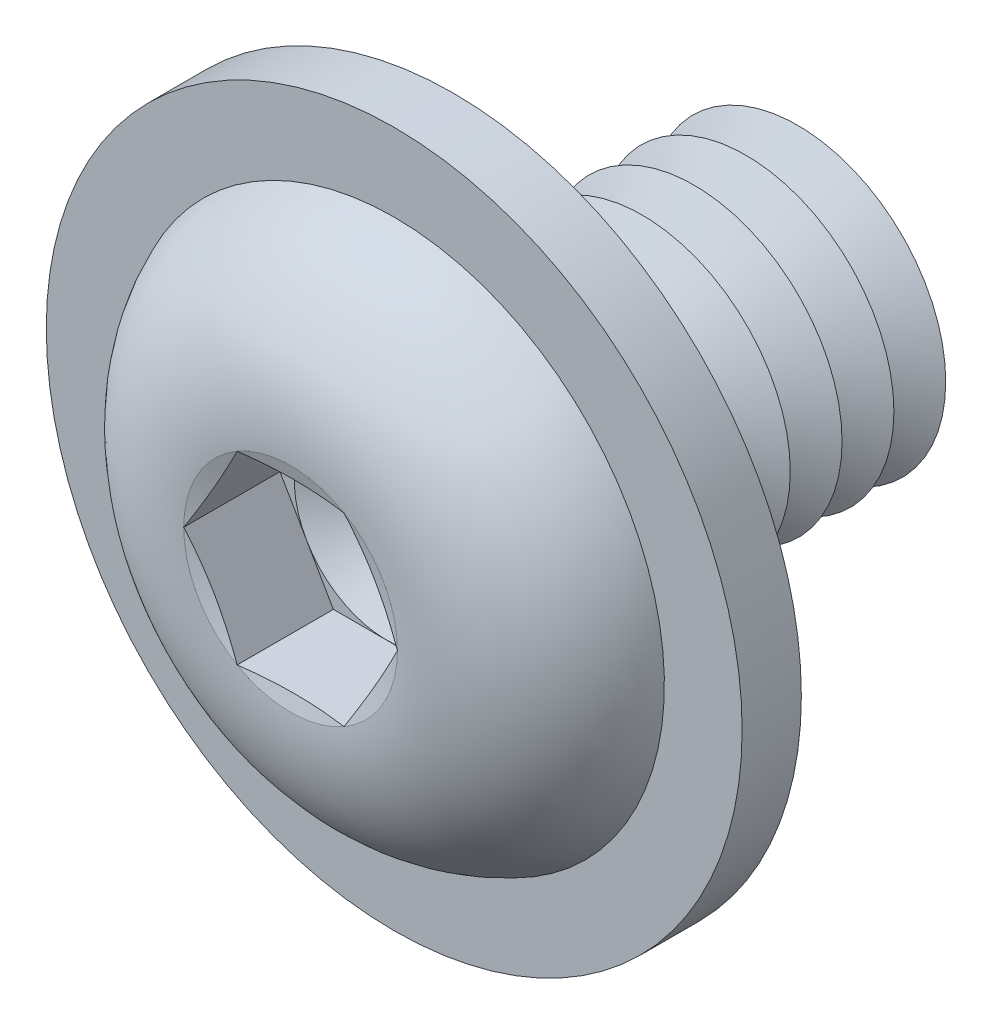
ISO-10303-21;
HEADER;
FILE_DESCRIPTION(('STEP AP214'),'2;1');
FILE_NAME('part.step','',(''),(''),'','','');
FILE_SCHEMA(('AUTOMOTIVE_DESIGN { 1 0 10303 214 1 1 1 1 }'));
ENDSEC;
DATA;
#1=APPLICATION_CONTEXT('core data for automotive mechanical design processes');
#2=APPLICATION_PROTOCOL_DEFINITION('international standard','automotive_design',2000,#1);
#3=PRODUCT_CONTEXT('',#1,'mechanical');
#4=PRODUCT('Part','Part','',(#3));
#5=PRODUCT_RELATED_PRODUCT_CATEGORY('part','',(#4));
#6=PRODUCT_DEFINITION_FORMATION('','',#4);
#7=PRODUCT_DEFINITION_CONTEXT('part definition',#1,'design');
#8=PRODUCT_DEFINITION('design','',#6,#7);
#9=PRODUCT_DEFINITION_SHAPE('','',#8);
#10=(LENGTH_UNIT() NAMED_UNIT(*) SI_UNIT(.MILLI.,.METRE.));
#11=(NAMED_UNIT(*) PLANE_ANGLE_UNIT() SI_UNIT($,.RADIAN.));
#12=(NAMED_UNIT(*) SI_UNIT($,.STERADIAN.) SOLID_ANGLE_UNIT());
#13=UNCERTAINTY_MEASURE_WITH_UNIT(LENGTH_MEASURE(1.E-05),#10,'distance_accuracy_value','');
#14=(GEOMETRIC_REPRESENTATION_CONTEXT(3) GLOBAL_UNCERTAINTY_ASSIGNED_CONTEXT((#13)) GLOBAL_UNIT_ASSIGNED_CONTEXT((#10,
#11,#12)) REPRESENTATION_CONTEXT('',''));
#15=CARTESIAN_POINT('',(0.,0.,0.));
#16=DIRECTION('',(0.,0.,1.));
#17=DIRECTION('',(1.,0.,0.));
#18=AXIS2_PLACEMENT_3D('',#15,#16,#17);
#19=CARTESIAN_POINT('',(0.,0.,-2.55));
#20=DIRECTION('',(0.,0.,1.));
#21=DIRECTION('',(1.,0.,0.));
#22=AXIS2_PLACEMENT_3D('',#19,#20,#21);
#23=CONICAL_SURFACE('',#22,2.,1.0471975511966);
#24=CARTESIAN_POINT('',(0.,0.,-2.9));
#25=DIRECTION('',(0.,0.,1.));
#26=DIRECTION('',(1.,0.,0.));
#27=AXIS2_PLACEMENT_3D('',#24,#25,#26);
#28=CIRCLE('',#27,1.39378221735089);
#29=CARTESIAN_POINT('',(1.39378221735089,0.,-2.9));
#30=VERTEX_POINT('',#29);
#31=EDGE_CURVE('E267',#30,#30,#28,.T.);
#32=ORIENTED_EDGE('',*,*,#31,.T.);
#33=EDGE_LOOP('',(#32));
#34=FACE_BOUND('',#33,.T.);
#35=CARTESIAN_POINT('',(0.,0.,-2.55));
#36=DIRECTION('',(0.,0.,1.));
#37=DIRECTION('',(1.,0.,0.));
#38=AXIS2_PLACEMENT_3D('',#35,#36,#37);
#39=CIRCLE('',#38,2.);
#40=CARTESIAN_POINT('',(2.,0.,-2.55));
#41=VERTEX_POINT('',#40);
#42=EDGE_CURVE('E263',#41,#41,#39,.T.);
#43=ORIENTED_EDGE('',*,*,#42,.F.);
#44=EDGE_LOOP('',(#43));
#45=FACE_BOUND('',#44,.T.);
#46=ADVANCED_FACE('F39',(#34,#45),#23,.T.);
#47=CARTESIAN_POINT('',(0.,0.,-2.9));
#48=DIRECTION('',(0.,0.,-1.));
#49=DIRECTION('',(-1.,0.,0.));
#50=AXIS2_PLACEMENT_3D('',#47,#48,#49);
#51=CONICAL_SURFACE('',#50,1.39378221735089,1.0471975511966);
#52=CARTESIAN_POINT('',(0.,0.,-3.25));
#53=DIRECTION('',(0.,0.,1.));
#54=DIRECTION('',(1.,0.,0.));
#55=AXIS2_PLACEMENT_3D('',#52,#53,#54);
#56=CIRCLE('',#55,2.);
#57=CARTESIAN_POINT('',(2.,0.,-3.25));
#58=VERTEX_POINT('',#57);
#59=EDGE_CURVE('E271',#58,#58,#56,.T.);
#60=ORIENTED_EDGE('',*,*,#59,.T.);
#61=EDGE_LOOP('',(#60));
#62=FACE_BOUND('',#61,.T.);
#63=ORIENTED_EDGE('',*,*,#31,.F.);
#64=EDGE_LOOP('',(#63));
#65=FACE_BOUND('',#64,.T.);
#66=ADVANCED_FACE('F388',(#62,#65),#51,.T.);
#67=CARTESIAN_POINT('',(0.,2.,-5.));
#68=DIRECTION('',(0.,0.,-1.));
#69=DIRECTION('',(-1.,0.,0.));
#70=AXIS2_PLACEMENT_3D('',#67,#68,#69);
#71=PLANE('',#70);
#72=CARTESIAN_POINT('',(0.,0.,-5.));
#73=DIRECTION('',(0.,0.,1.));
#74=DIRECTION('',(1.,0.,0.));
#75=AXIS2_PLACEMENT_3D('',#72,#73,#74);
#76=CIRCLE('',#75,1.39378221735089);
#77=CARTESIAN_POINT('',(1.39378221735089,0.,-5.));
#78=VERTEX_POINT('',#77);
#79=EDGE_CURVE('E291',#78,#78,#76,.T.);
#80=ORIENTED_EDGE('',*,*,#79,.F.);
#81=EDGE_LOOP('',(#80));
#82=FACE_BOUND('',#81,.T.);
#83=ADVANCED_FACE('F394',(#82),#71,.T.);
#84=CARTESIAN_POINT('',(0.,0.,-4.65));
#85=DIRECTION('',(0.,0.,1.));
#86=DIRECTION('',(1.,0.,0.));
#87=AXIS2_PLACEMENT_3D('',#84,#85,#86);
#88=CONICAL_SURFACE('',#87,2.,1.0471975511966);
#89=ORIENTED_EDGE('',*,*,#79,.T.);
#90=EDGE_LOOP('',(#89));
#91=FACE_BOUND('',#90,.T.);
#92=CARTESIAN_POINT('',(0.,0.,-4.65));
#93=DIRECTION('',(0.,0.,1.));
#94=DIRECTION('',(1.,0.,0.));
#95=AXIS2_PLACEMENT_3D('',#92,#93,#94);
#96=CIRCLE('',#95,2.);
#97=CARTESIAN_POINT('',(2.,0.,-4.65));
#98=VERTEX_POINT('',#97);
#99=EDGE_CURVE('E287',#98,#98,#96,.T.);
#100=ORIENTED_EDGE('',*,*,#99,.F.);
#101=EDGE_LOOP('',(#100));
#102=FACE_BOUND('',#101,.T.);
#103=ADVANCED_FACE('F413',(#91,#102),#88,.T.);
#104=CARTESIAN_POINT('',(0.,0.,-4.3));
#105=DIRECTION('',(0.,0.,-1.));
#106=DIRECTION('',(-1.,0.,0.));
#107=AXIS2_PLACEMENT_3D('',#104,#105,#106);
#108=CONICAL_SURFACE('',#107,1.39378221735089,1.0471975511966);
#109=ORIENTED_EDGE('',*,*,#99,.T.);
#110=EDGE_LOOP('',(#109));
#111=FACE_BOUND('',#110,.T.);
#112=CARTESIAN_POINT('',(0.,0.,-4.3));
#113=DIRECTION('',(0.,0.,1.));
#114=DIRECTION('',(1.,0.,0.));
#115=AXIS2_PLACEMENT_3D('',#112,#113,#114);
#116=CIRCLE('',#115,1.39378221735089);
#117=CARTESIAN_POINT('',(1.39378221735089,0.,-4.3));
#118=VERTEX_POINT('',#117);
#119=EDGE_CURVE('E283',#118,#118,#116,.T.);
#120=ORIENTED_EDGE('',*,*,#119,.F.);
#121=EDGE_LOOP('',(#120));
#122=FACE_BOUND('',#121,.T.);
#123=ADVANCED_FACE('F410',(#111,#122),#108,.T.);
#124=CARTESIAN_POINT('',(0.,0.,-3.95));
#125=DIRECTION('',(0.,0.,1.));
#126=DIRECTION('',(1.,0.,0.));
#127=AXIS2_PLACEMENT_3D('',#124,#125,#126);
#128=CONICAL_SURFACE('',#127,2.,1.0471975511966);
#129=ORIENTED_EDGE('',*,*,#119,.T.);
#130=EDGE_LOOP('',(#129));
#131=FACE_BOUND('',#130,.T.);
#132=CARTESIAN_POINT('',(0.,0.,-3.95));
#133=DIRECTION('',(0.,0.,1.));
#134=DIRECTION('',(1.,0.,0.));
#135=AXIS2_PLACEMENT_3D('',#132,#133,#134);
#136=CIRCLE('',#135,2.);
#137=CARTESIAN_POINT('',(2.,0.,-3.95));
#138=VERTEX_POINT('',#137);
#139=EDGE_CURVE('E279',#138,#138,#136,.T.);
#140=ORIENTED_EDGE('',*,*,#139,.F.);
#141=EDGE_LOOP('',(#140));
#142=FACE_BOUND('',#141,.T.);
#143=ADVANCED_FACE('F404',(#131,#142),#128,.T.);
#144=CARTESIAN_POINT('',(0.,0.,-3.6));
#145=DIRECTION('',(0.,0.,-1.));
#146=DIRECTION('',(-1.,0.,0.));
#147=AXIS2_PLACEMENT_3D('',#144,#145,#146);
#148=CONICAL_SURFACE('',#147,1.39378221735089,1.0471975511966);
#149=ORIENTED_EDGE('',*,*,#139,.T.);
#150=EDGE_LOOP('',(#149));
#151=FACE_BOUND('',#150,.T.);
#152=CARTESIAN_POINT('',(0.,0.,-3.6));
#153=DIRECTION('',(0.,0.,1.));
#154=DIRECTION('',(1.,0.,0.));
#155=AXIS2_PLACEMENT_3D('',#152,#153,#154);
#156=CIRCLE('',#155,1.39378221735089);
#157=CARTESIAN_POINT('',(1.39378221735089,0.,-3.6));
#158=VERTEX_POINT('',#157);
#159=EDGE_CURVE('E275',#158,#158,#156,.T.);
#160=ORIENTED_EDGE('',*,*,#159,.F.);
#161=EDGE_LOOP('',(#160));
#162=FACE_BOUND('',#161,.T.);
#163=ADVANCED_FACE('F400',(#151,#162),#148,.T.);
#164=CARTESIAN_POINT('',(0.,0.,-3.25));
#165=DIRECTION('',(0.,0.,1.));
#166=DIRECTION('',(1.,0.,0.));
#167=AXIS2_PLACEMENT_3D('',#164,#165,#166);
#168=CONICAL_SURFACE('',#167,2.,1.0471975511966);
#169=ORIENTED_EDGE('',*,*,#159,.T.);
#170=EDGE_LOOP('',(#169));
#171=FACE_BOUND('',#170,.T.);
#172=ORIENTED_EDGE('',*,*,#59,.F.);
#173=EDGE_LOOP('',(#172));
#174=FACE_BOUND('',#173,.T.);
#175=ADVANCED_FACE('F403',(#171,#174),#168,.T.);
#176=CARTESIAN_POINT('',(0.,0.,-1.85));
#177=DIRECTION('',(0.,0.,1.));
#178=DIRECTION('',(1.,0.,0.));
#179=AXIS2_PLACEMENT_3D('',#176,#177,#178);
#180=CONICAL_SURFACE('',#179,2.,1.0471975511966);
#181=CARTESIAN_POINT('',(0.,0.,-2.2));
#182=DIRECTION('',(0.,0.,1.));
#183=DIRECTION('',(1.,0.,0.));
#184=AXIS2_PLACEMENT_3D('',#181,#182,#183);
#185=CIRCLE('',#184,1.39378221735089);
#186=CARTESIAN_POINT('',(1.39378221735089,0.,-2.2));
#187=VERTEX_POINT('',#186);
#188=EDGE_CURVE('E259',#187,#187,#185,.T.);
#189=ORIENTED_EDGE('',*,*,#188,.T.);
#190=EDGE_LOOP('',(#189));
#191=FACE_BOUND('',#190,.T.);
#192=CARTESIAN_POINT('',(0.,0.,-1.85));
#193=DIRECTION('',(0.,0.,1.));
#194=DIRECTION('',(1.,0.,0.));
#195=AXIS2_PLACEMENT_3D('',#192,#193,#194);
#196=CIRCLE('',#195,2.);
#197=CARTESIAN_POINT('',(2.,0.,-1.85));
#198=VERTEX_POINT('',#197);
#199=EDGE_CURVE('E255',#198,#198,#196,.T.);
#200=ORIENTED_EDGE('',*,*,#199,.F.);
#201=EDGE_LOOP('',(#200));
#202=FACE_BOUND('',#201,.T.);
#203=ADVANCED_FACE('F408',(#191,#202),#180,.T.);
#204=CARTESIAN_POINT('',(0.,0.,-2.2));
#205=DIRECTION('',(0.,0.,-1.));
#206=DIRECTION('',(-1.,0.,0.));
#207=AXIS2_PLACEMENT_3D('',#204,#205,#206);
#208=CONICAL_SURFACE('',#207,1.39378221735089,1.0471975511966);
#209=ORIENTED_EDGE('',*,*,#42,.T.);
#210=EDGE_LOOP('',(#209));
#211=FACE_BOUND('',#210,.T.);
#212=ORIENTED_EDGE('',*,*,#188,.F.);
#213=EDGE_LOOP('',(#212));
#214=FACE_BOUND('',#213,.T.);
#215=ADVANCED_FACE('F459',(#211,#214),#208,.T.);
#216=CARTESIAN_POINT('',(0.,0.,-1.15));
#217=DIRECTION('',(0.,0.,1.));
#218=DIRECTION('',(1.,0.,0.));
#219=AXIS2_PLACEMENT_3D('',#216,#217,#218);
#220=CONICAL_SURFACE('',#219,2.,1.0471975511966);
#221=CARTESIAN_POINT('',(0.,0.,-1.5));
#222=DIRECTION('',(0.,0.,1.));
#223=DIRECTION('',(1.,0.,0.));
#224=AXIS2_PLACEMENT_3D('',#221,#222,#223);
#225=CIRCLE('',#224,1.39378221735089);
#226=CARTESIAN_POINT('',(1.39378221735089,0.,-1.5));
#227=VERTEX_POINT('',#226);
#228=EDGE_CURVE('E251',#227,#227,#225,.T.);
#229=ORIENTED_EDGE('',*,*,#228,.T.);
#230=EDGE_LOOP('',(#229));
#231=FACE_BOUND('',#230,.T.);
#232=CARTESIAN_POINT('',(0.,0.,-1.15));
#233=DIRECTION('',(0.,0.,1.));
#234=DIRECTION('',(1.,0.,0.));
#235=AXIS2_PLACEMENT_3D('',#232,#233,#234);
#236=CIRCLE('',#235,2.);
#237=CARTESIAN_POINT('',(2.,0.,-1.15));
#238=VERTEX_POINT('',#237);
#239=EDGE_CURVE('E243',#238,#238,#236,.T.);
#240=ORIENTED_EDGE('',*,*,#239,.F.);
#241=EDGE_LOOP('',(#240));
#242=FACE_BOUND('',#241,.T.);
#243=ADVANCED_FACE('F465',(#231,#242),#220,.T.);
#244=CARTESIAN_POINT('',(0.,0.,-1.5));
#245=DIRECTION('',(0.,0.,-1.));
#246=DIRECTION('',(-1.,0.,0.));
#247=AXIS2_PLACEMENT_3D('',#244,#245,#246);
#248=CONICAL_SURFACE('',#247,1.39378221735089,1.0471975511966);
#249=ORIENTED_EDGE('',*,*,#199,.T.);
#250=EDGE_LOOP('',(#249));
#251=FACE_BOUND('',#250,.T.);
#252=ORIENTED_EDGE('',*,*,#228,.F.);
#253=EDGE_LOOP('',(#252));
#254=FACE_BOUND('',#253,.T.);
#255=ADVANCED_FACE('F472',(#251,#254),#248,.T.);
#256=CARTESIAN_POINT('',(0.,0.,-0.45));
#257=DIRECTION('',(0.,0.,1.));
#258=DIRECTION('',(1.,0.,0.));
#259=AXIS2_PLACEMENT_3D('',#256,#257,#258);
#260=CONICAL_SURFACE('',#259,2.,1.0471975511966);
#261=CARTESIAN_POINT('',(0.,0.,-0.799999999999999));
#262=DIRECTION('',(0.,0.,1.));
#263=DIRECTION('',(1.,0.,0.));
#264=AXIS2_PLACEMENT_3D('',#261,#262,#263);
#265=CIRCLE('',#264,1.39378221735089);
#266=CARTESIAN_POINT('',(1.39378221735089,0.,-0.799999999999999));
#267=VERTEX_POINT('',#266);
#268=EDGE_CURVE('E232',#267,#267,#265,.T.);
#269=ORIENTED_EDGE('',*,*,#268,.T.);
#270=EDGE_LOOP('',(#269));
#271=FACE_BOUND('',#270,.T.);
#272=CARTESIAN_POINT('',(0.,0.,-0.45));
#273=DIRECTION('',(0.,0.,1.));
#274=DIRECTION('',(1.,0.,0.));
#275=AXIS2_PLACEMENT_3D('',#272,#273,#274);
#276=CIRCLE('',#275,2.);
#277=CARTESIAN_POINT('',(2.,0.,-0.45));
#278=VERTEX_POINT('',#277);
#279=EDGE_CURVE('E247',#278,#278,#276,.T.);
#280=ORIENTED_EDGE('',*,*,#279,.F.);
#281=EDGE_LOOP('',(#280));
#282=FACE_BOUND('',#281,.T.);
#283=ADVANCED_FACE('F479',(#271,#282),#260,.T.);
#284=CARTESIAN_POINT('',(0.,0.,-0.799999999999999));
#285=DIRECTION('',(0.,0.,-1.));
#286=DIRECTION('',(-1.,0.,0.));
#287=AXIS2_PLACEMENT_3D('',#284,#285,#286);
#288=CONICAL_SURFACE('',#287,1.39378221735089,1.0471975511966);
#289=ORIENTED_EDGE('',*,*,#239,.T.);
#290=EDGE_LOOP('',(#289));
#291=FACE_BOUND('',#290,.T.);
#292=ORIENTED_EDGE('',*,*,#268,.F.);
#293=EDGE_LOOP('',(#292));
#294=FACE_BOUND('',#293,.T.);
#295=ADVANCED_FACE('F221',(#291,#294),#288,.T.);
#296=CARTESIAN_POINT('',(0.,2.,0.));
#297=DIRECTION('',(0.,0.,-1.));
#298=DIRECTION('',(-1.,0.,0.));
#299=AXIS2_PLACEMENT_3D('',#296,#297,#298);
#300=PLANE('',#299);
#301=CARTESIAN_POINT('',(0.,0.,0.));
#302=DIRECTION('',(0.,0.,-1.));
#303=DIRECTION('',(-1.,0.,0.));
#304=AXIS2_PLACEMENT_3D('',#301,#302,#303);
#305=CIRCLE('',#304,2.35);
#306=CARTESIAN_POINT('',(-2.35,0.,0.));
#307=VERTEX_POINT('',#306);
#308=EDGE_CURVE('E305',#307,#307,#305,.F.);
#309=ORIENTED_EDGE('',*,*,#308,.T.);
#310=EDGE_LOOP('',(#309));
#311=FACE_BOUND('',#310,.T.);
#312=CARTESIAN_POINT('',(0.,0.,0.));
#313=DIRECTION('',(0.,0.,-1.));
#314=DIRECTION('',(0.,1.,0.));
#315=AXIS2_PLACEMENT_3D('',#312,#313,#314);
#316=CIRCLE('',#315,4.7);
#317=CARTESIAN_POINT('',(0.,4.7,0.));
#318=VERTEX_POINT('',#317);
#319=EDGE_CURVE('E776',#318,#318,#316,.T.);
#320=ORIENTED_EDGE('',*,*,#319,.T.);
#321=EDGE_LOOP('',(#320));
#322=FACE_BOUND('',#321,.T.);
#323=ADVANCED_FACE('F491',(#311,#322),#300,.T.);
#324=CARTESIAN_POINT('',(0.,0.,-0.35));
#325=DIRECTION('',(0.,0.,-1.));
#326=DIRECTION('',(-1.,0.,0.));
#327=AXIS2_PLACEMENT_3D('',#324,#325,#326);
#328=TOROIDAL_SURFACE('',#327,2.35,0.35);
#329=ORIENTED_EDGE('',*,*,#308,.F.);
#330=EDGE_LOOP('',(#329));
#331=FACE_BOUND('',#330,.T.);
#332=CARTESIAN_POINT('',(0.,0.,-0.35));
#333=DIRECTION('',(0.,0.,-1.));
#334=DIRECTION('',(-1.,0.,0.));
#335=AXIS2_PLACEMENT_3D('',#332,#333,#334);
#336=CIRCLE('',#335,2.);
#337=CARTESIAN_POINT('',(-2.,0.,-0.35));
#338=VERTEX_POINT('',#337);
#339=EDGE_CURVE('E300',#338,#338,#336,.T.);
#340=ORIENTED_EDGE('',*,*,#339,.F.);
#341=EDGE_LOOP('',(#340));
#342=FACE_BOUND('',#341,.T.);
#343=ADVANCED_FACE('F41',(#331,#342),#328,.F.);
#344=CARTESIAN_POINT('',(0.,0.,-5.));
#345=DIRECTION('',(0.,0.,-1.));
#346=DIRECTION('',(-1.,0.,0.));
#347=AXIS2_PLACEMENT_3D('',#344,#345,#346);
#348=CYLINDRICAL_SURFACE('',#347,2.);
#349=ORIENTED_EDGE('',*,*,#339,.T.);
#350=EDGE_LOOP('',(#349));
#351=FACE_BOUND('',#350,.T.);
#352=ORIENTED_EDGE('',*,*,#279,.T.);
#353=EDGE_LOOP('',(#352));
#354=FACE_BOUND('',#353,.T.);
#355=ADVANCED_FACE('F503',(#351,#354),#348,.T.);
#356=CARTESIAN_POINT('',(0.,0.,0.8));
#357=DIRECTION('',(0.,0.,-1.));
#358=DIRECTION('',(0.,1.,0.));
#359=AXIS2_PLACEMENT_3D('',#356,#357,#358);
#360=CYLINDRICAL_SURFACE('',#359,4.7);
#361=CARTESIAN_POINT('',(0.,0.,0.8));
#362=DIRECTION('',(0.,0.,-1.));
#363=DIRECTION('',(0.,1.,0.));
#364=AXIS2_PLACEMENT_3D('',#361,#362,#363);
#365=CIRCLE('',#364,4.7);
#366=CARTESIAN_POINT('',(0.,4.7,0.8));
#367=VERTEX_POINT('',#366);
#368=EDGE_CURVE('E778',#367,#367,#365,.T.);
#369=ORIENTED_EDGE('',*,*,#368,.T.);
#370=EDGE_LOOP('',(#369));
#371=FACE_BOUND('',#370,.T.);
#372=ORIENTED_EDGE('',*,*,#319,.F.);
#373=EDGE_LOOP('',(#372));
#374=FACE_BOUND('',#373,.T.);
#375=ADVANCED_FACE('F509',(#371,#374),#360,.T.);
#376=CARTESIAN_POINT('',(0.,0.,0.8));
#377=DIRECTION('',(0.,0.,-1.));
#378=DIRECTION('',(0.,1.,0.));
#379=AXIS2_PLACEMENT_3D('',#376,#377,#378);
#380=PLANE('',#379);
#381=CARTESIAN_POINT('',(0.,0.,0.8));
#382=DIRECTION('',(0.,0.,-1.));
#383=DIRECTION('',(0.,1.,0.));
#384=AXIS2_PLACEMENT_3D('',#381,#382,#383);
#385=CIRCLE('',#384,3.64977164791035);
#386=CARTESIAN_POINT('',(0.,3.64977164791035,0.8));
#387=VERTEX_POINT('',#386);
#388=EDGE_CURVE('E43',#387,#387,#385,.F.);
#389=ORIENTED_EDGE('',*,*,#388,.F.);
#390=EDGE_LOOP('',(#389));
#391=FACE_BOUND('',#390,.T.);
#392=ORIENTED_EDGE('',*,*,#368,.F.);
#393=EDGE_LOOP('',(#392));
#394=FACE_BOUND('',#393,.T.);
#395=ADVANCED_FACE('F117',(#391,#394),#380,.F.);
#396=CARTESIAN_POINT('',(0.,0.,0.9));
#397=DIRECTION('',(0.,0.,1.));
#398=DIRECTION('',(1.,0.,0.));
#399=AXIS2_PLACEMENT_3D('',#396,#397,#398);
#400=CONICAL_SURFACE('',#399,1.24999941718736,1.0471975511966);
#401=CARTESIAN_POINT('',(0.,0.,0.178312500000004));
#402=VERTEX_POINT('',#401);
#403=VERTEX_LOOP('',#402);
#404=FACE_BOUND('',#403,.T.);
#405=CARTESIAN_POINT('',(0.,0.,0.9));
#406=DIRECTION('',(0.,0.,1.));
#407=DIRECTION('',(1.,0.,0.));
#408=AXIS2_PLACEMENT_3D('',#405,#406,#407);
#409=CIRCLE('',#408,1.24999941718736);
#410=CARTESIAN_POINT('',(1.08253125,0.624999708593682,0.9));
#411=VERTEX_POINT('',#410);
#412=CARTESIAN_POINT('',(0.,1.24999941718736,0.9));
#413=VERTEX_POINT('',#412);
#414=EDGE_CURVE('E120',#411,#413,#409,.T.);
#415=ORIENTED_EDGE('',*,*,#414,.T.);
#416=CARTESIAN_POINT('',(0.,0.,0.9));
#417=DIRECTION('',(0.,0.,1.));
#418=DIRECTION('',(1.,0.,0.));
#419=AXIS2_PLACEMENT_3D('',#416,#417,#418);
#420=CIRCLE('',#419,1.24999941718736);
#421=CARTESIAN_POINT('',(-1.08253125,0.624999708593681,0.9));
#422=VERTEX_POINT('',#421);
#423=EDGE_CURVE('E11',#413,#422,#420,.T.);
#424=ORIENTED_EDGE('',*,*,#423,.T.);
#425=CARTESIAN_POINT('',(-1.08253125,-0.624999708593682,0.9));
#426=VERTEX_POINT('',#425);
#427=EDGE_CURVE('E49',#422,#426,#420,.T.);
#428=ORIENTED_EDGE('',*,*,#427,.T.);
#429=CARTESIAN_POINT('',(0.,-1.24999941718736,0.9));
#430=VERTEX_POINT('',#429);
#431=EDGE_CURVE('E312',#426,#430,#420,.T.);
#432=ORIENTED_EDGE('',*,*,#431,.T.);
#433=CARTESIAN_POINT('',(1.08253125,-0.624999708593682,0.9));
#434=VERTEX_POINT('',#433);
#435=EDGE_CURVE('E57',#430,#434,#420,.T.);
#436=ORIENTED_EDGE('',*,*,#435,.T.);
#437=EDGE_CURVE('E50',#434,#411,#420,.T.);
#438=ORIENTED_EDGE('',*,*,#437,.T.);
#439=EDGE_LOOP('',(#415,#424,#428,#432,#436,#438));
#440=FACE_BOUND('',#439,.T.);
#441=ADVANCED_FACE('F114',(#404,#440),#400,.F.);
#442=CARTESIAN_POINT('',(0.,0.,0.9));
#443=DIRECTION('',(0.,0.,1.));
#444=DIRECTION('',(1.,0.,0.));
#445=AXIS2_PLACEMENT_3D('',#442,#443,#444);
#446=PLANE('',#445);
#447=ORIENTED_EDGE('',*,*,#431,.F.);
#448=DIRECTION('',(0.5,-0.866025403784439,0.));
#449=VECTOR('',#448,1.);
#450=CARTESIAN_POINT('',(-1.443375,0.,0.9));
#451=LINE('',#450,#449);
#452=CARTESIAN_POINT('',(-0.7216875,-1.24999941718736,0.9));
#453=VERTEX_POINT('',#452);
#454=EDGE_CURVE('E154',#426,#453,#451,.T.);
#455=ORIENTED_EDGE('',*,*,#454,.T.);
#456=DIRECTION('',(1.,0.,0.));
#457=VECTOR('',#456,1.);
#458=CARTESIAN_POINT('',(-0.7216875,-1.24999941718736,0.9));
#459=LINE('',#458,#457);
#460=EDGE_CURVE('E160',#453,#430,#459,.T.);
#461=ORIENTED_EDGE('',*,*,#460,.T.);
#462=EDGE_LOOP('',(#447,#455,#461));
#463=FACE_BOUND('',#462,.T.);
#464=ADVANCED_FACE('F116',(#463),#446,.T.);
#465=ORIENTED_EDGE('',*,*,#435,.F.);
#466=CARTESIAN_POINT('',(0.721687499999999,-1.24999941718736,0.9));
#467=VERTEX_POINT('',#466);
#468=EDGE_CURVE('E159',#430,#467,#459,.T.);
#469=ORIENTED_EDGE('',*,*,#468,.T.);
#470=DIRECTION('',(0.5,0.866025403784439,0.));
#471=VECTOR('',#470,1.);
#472=CARTESIAN_POINT('',(0.721687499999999,-1.24999941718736,0.9));
#473=LINE('',#472,#471);
#474=EDGE_CURVE('E165',#467,#434,#473,.T.);
#475=ORIENTED_EDGE('',*,*,#474,.T.);
#476=EDGE_LOOP('',(#465,#469,#475));
#477=FACE_BOUND('',#476,.T.);
#478=ADVANCED_FACE('F530',(#477),#446,.T.);
#479=ORIENTED_EDGE('',*,*,#437,.F.);
#480=CARTESIAN_POINT('',(1.443375,0.,0.9));
#481=VERTEX_POINT('',#480);
#482=EDGE_CURVE('E164',#434,#481,#473,.T.);
#483=ORIENTED_EDGE('',*,*,#482,.T.);
#484=DIRECTION('',(-0.5,0.866025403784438,0.));
#485=VECTOR('',#484,1.);
#486=CARTESIAN_POINT('',(1.443375,0.,0.9));
#487=LINE('',#486,#485);
#488=EDGE_CURVE('E142',#481,#411,#487,.T.);
#489=ORIENTED_EDGE('',*,*,#488,.T.);
#490=EDGE_LOOP('',(#479,#483,#489));
#491=FACE_BOUND('',#490,.T.);
#492=ADVANCED_FACE('F535',(#491),#446,.T.);
#493=ORIENTED_EDGE('',*,*,#414,.F.);
#494=CARTESIAN_POINT('',(0.7216875,1.24999941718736,0.9));
#495=VERTEX_POINT('',#494);
#496=EDGE_CURVE('E127',#411,#495,#487,.T.);
#497=ORIENTED_EDGE('',*,*,#496,.T.);
#498=DIRECTION('',(-1.,0.,0.));
#499=VECTOR('',#498,1.);
#500=CARTESIAN_POINT('',(0.7216875,1.24999941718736,0.9));
#501=LINE('',#500,#499);
#502=EDGE_CURVE('E138',#495,#413,#501,.T.);
#503=ORIENTED_EDGE('',*,*,#502,.T.);
#504=EDGE_LOOP('',(#493,#497,#503));
#505=FACE_BOUND('',#504,.T.);
#506=ADVANCED_FACE('F144',(#505),#446,.T.);
#507=ORIENTED_EDGE('',*,*,#423,.F.);
#508=CARTESIAN_POINT('',(-0.721687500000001,1.24999941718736,0.9));
#509=VERTEX_POINT('',#508);
#510=EDGE_CURVE('E133',#413,#509,#501,.T.);
#511=ORIENTED_EDGE('',*,*,#510,.T.);
#512=DIRECTION('',(-0.5,-0.866025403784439,0.));
#513=VECTOR('',#512,1.);
#514=CARTESIAN_POINT('',(-0.721687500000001,1.24999941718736,0.9));
#515=LINE('',#514,#513);
#516=EDGE_CURVE('E136',#509,#422,#515,.T.);
#517=ORIENTED_EDGE('',*,*,#516,.T.);
#518=EDGE_LOOP('',(#507,#511,#517));
#519=FACE_BOUND('',#518,.T.);
#520=ADVANCED_FACE('F132',(#519),#446,.T.);
#521=ORIENTED_EDGE('',*,*,#427,.F.);
#522=CARTESIAN_POINT('',(-1.443375,0.,0.9));
#523=VERTEX_POINT('',#522);
#524=EDGE_CURVE('E146',#422,#523,#515,.T.);
#525=ORIENTED_EDGE('',*,*,#524,.T.);
#526=EDGE_CURVE('E155',#523,#426,#451,.T.);
#527=ORIENTED_EDGE('',*,*,#526,.T.);
#528=EDGE_LOOP('',(#521,#525,#527));
#529=FACE_BOUND('',#528,.T.);
#530=ADVANCED_FACE('F327',(#529),#446,.T.);
#531=CARTESIAN_POINT('',(-1.443375,0.,0.9));
#532=DIRECTION('',(-0.866025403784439,-0.5,0.));
#533=DIRECTION('',(0.5,-0.866025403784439,0.));
#534=AXIS2_PLACEMENT_3D('',#531,#532,#533);
#535=PLANE('',#534);
#536=CARTESIAN_POINT('',(-1.44349047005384,0.000200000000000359,2.20003094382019));
#537=CARTESIAN_POINT('',(-1.41351104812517,-0.0517258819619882,2.19199301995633));
#538=CARTESIAN_POINT('',(-1.38347725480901,-0.10374593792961,2.18469579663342));
#539=CARTESIAN_POINT('',(-1.32330355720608,-0.20796983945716,2.17187512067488));
#540=CARTESIAN_POINT('',(-1.29316361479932,-0.260173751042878,2.16635238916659));
#541=CARTESIAN_POINT('',(-1.23296043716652,-0.364448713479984,2.15740323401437));
#542=CARTESIAN_POINT('',(-1.20289760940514,-0.416519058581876,2.15396613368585));
#543=CARTESIAN_POINT('',(-1.14273359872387,-0.520726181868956,2.14935732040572));
#544=CARTESIAN_POINT('',(-1.11263242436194,-0.572862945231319,2.14818516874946));
#545=CARTESIAN_POINT('',(-1.05243007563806,-0.677136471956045,2.14818516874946));
#546=CARTESIAN_POINT('',(-1.02232890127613,-0.729273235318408,2.14935732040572));
#547=CARTESIAN_POINT('',(-0.962164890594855,-0.833480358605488,2.15396613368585));
#548=CARTESIAN_POINT('',(-0.932102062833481,-0.88555070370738,2.15740323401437));
#549=CARTESIAN_POINT('',(-0.87189888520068,-0.989825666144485,2.16635238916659));
#550=CARTESIAN_POINT('',(-0.841758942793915,-1.0420295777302,2.17187512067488));
#551=CARTESIAN_POINT('',(-0.78158524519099,-1.14625347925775,2.18469579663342));
#552=CARTESIAN_POINT('',(-0.751551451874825,-1.19827353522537,2.19199301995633));
#553=CARTESIAN_POINT('',(-0.721572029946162,-1.25019941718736,2.20003094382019));
#554=B_SPLINE_CURVE_WITH_KNOTS('',3,(#536,#537,#538,#539,#540,#541,#542,#543,#544,#545,#546,
#547,#548,#549,#550,#551,#552,#553),.UNSPECIFIED.,.F.,.F.,(4,2,2,2,2,2,2,2,4),(0.,
0.181495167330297,0.363063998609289,0.543695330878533,0.724291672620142,0.904888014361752,
1.08551934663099,1.26708817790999,1.44858334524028),.UNSPECIFIED.);
#555=CARTESIAN_POINT('',(-1.443375,0.,2.2));
#556=VERTEX_POINT('',#555);
#557=CARTESIAN_POINT('',(-0.7216875,-1.24999941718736,2.2));
#558=VERTEX_POINT('',#557);
#559=EDGE_CURVE('E332',#556,#558,#554,.T.);
#560=ORIENTED_EDGE('',*,*,#559,.T.);
#561=DIRECTION('',(0.,0.,1.));
#562=VECTOR('',#561,1.);
#563=CARTESIAN_POINT('',(-0.7216875,-1.24999941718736,0.9));
#564=LINE('',#563,#562);
#565=EDGE_CURVE('E178',#453,#558,#564,.T.);
#566=ORIENTED_EDGE('',*,*,#565,.F.);
#567=ORIENTED_EDGE('',*,*,#454,.F.);
#568=ORIENTED_EDGE('',*,*,#526,.F.);
#569=DIRECTION('',(0.,0.,1.));
#570=VECTOR('',#569,1.);
#571=CARTESIAN_POINT('',(-1.443375,0.,0.9));
#572=LINE('',#571,#570);
#573=EDGE_CURVE('E182',#523,#556,#572,.T.);
#574=ORIENTED_EDGE('',*,*,#573,.T.);
#575=EDGE_LOOP('',(#560,#566,#567,#568,#574));
#576=FACE_BOUND('',#575,.T.);
#577=ADVANCED_FACE('F325',(#576),#535,.F.);
#578=CARTESIAN_POINT('',(-0.7216875,-1.24999941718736,0.9));
#579=DIRECTION('',(0.,-1.,0.));
#580=DIRECTION('',(0.,0.,-1.));
#581=AXIS2_PLACEMENT_3D('',#578,#579,#580);
#582=PLANE('',#581);
#583=CARTESIAN_POINT('',(-2.17815859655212,-1.24999941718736,2.48616275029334));
#584=CARTESIAN_POINT('',(-2.07269794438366,-1.24999941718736,2.4616881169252));
#585=CARTESIAN_POINT('',(-1.96714913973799,-1.24999941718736,2.43756889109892));
#586=CARTESIAN_POINT('',(-1.75576352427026,-1.24999941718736,2.39052699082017));
#587=CARTESIAN_POINT('',(-1.64992665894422,-1.24999941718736,2.36760456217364));
#588=CARTESIAN_POINT('',(-1.43690237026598,-1.24999941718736,2.3232454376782));
#589=CARTESIAN_POINT('',(-1.32971158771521,-1.24999941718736,2.30182468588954));
#590=CARTESIAN_POINT('',(-1.1148274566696,-1.24999941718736,2.26156703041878));
#591=CARTESIAN_POINT('',(-1.00713406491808,-1.24999941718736,2.24273035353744));
#592=CARTESIAN_POINT('',(-0.794044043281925,-1.24999941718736,2.2093913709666));
#593=CARTESIAN_POINT('',(-0.688664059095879,-1.24999941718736,2.19478562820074));
#594=CARTESIAN_POINT('',(-0.477310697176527,-1.24999941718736,2.17085809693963));
#595=CARTESIAN_POINT('',(-0.371337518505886,-1.24999941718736,2.16153463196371));
#596=CARTESIAN_POINT('',(-0.159455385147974,-1.24999941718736,2.14976770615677));
#597=CARTESIAN_POINT('',(-0.0535482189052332,-1.24999941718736,2.14729400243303));
#598=CARTESIAN_POINT('',(0.158189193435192,-1.24999941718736,2.14966287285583));
#599=CARTESIAN_POINT('',(0.264019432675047,-1.24999941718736,2.15450603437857));
#600=CARTESIAN_POINT('',(0.445148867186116,-1.24999941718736,2.16825380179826));
#601=CARTESIAN_POINT('',(0.520574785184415,-1.24999941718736,2.17561242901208));
#602=CARTESIAN_POINT('',(0.671115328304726,-1.24999941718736,2.19297000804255));
#603=CARTESIAN_POINT('',(0.746229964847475,-1.24999941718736,2.20296886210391));
#604=CARTESIAN_POINT('',(0.896387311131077,-1.24999941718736,2.22505910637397));
#605=CARTESIAN_POINT('',(0.971429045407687,-1.24999941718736,2.23715700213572));
#606=CARTESIAN_POINT('',(1.12124320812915,-1.24999941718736,2.26292371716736));
#607=CARTESIAN_POINT('',(1.19601562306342,-1.24999941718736,2.27659261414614));
#608=CARTESIAN_POINT('',(1.34686913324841,-1.24999941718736,2.30540811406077));
#609=CARTESIAN_POINT('',(1.42294548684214,-1.24999941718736,2.32057934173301));
#610=CARTESIAN_POINT('',(1.57490676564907,-1.24999941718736,2.351851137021));
#611=CARTESIAN_POINT('',(1.65079168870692,-1.24999941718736,2.36795171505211));
#612=CARTESIAN_POINT('',(1.80199501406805,-1.24999941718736,2.40076814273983));
#613=CARTESIAN_POINT('',(1.87731425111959,-1.24999941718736,2.41748016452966));
#614=CARTESIAN_POINT('',(2.02782424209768,-1.24999941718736,2.45144971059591));
#615=CARTESIAN_POINT('',(2.10301500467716,-1.24999941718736,2.46870719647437));
#616=CARTESIAN_POINT('',(2.17815859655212,-1.24999941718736,2.48616275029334));
#617=B_SPLINE_CURVE_WITH_KNOTS('',3,(#583,#584,#585,#586,#587,#588,#589,#590,#591,#592,#593,
#594,#595,#596,#597,#598,#599,#600,#601,#602,#603,#604,#605,#606,#607,#608,#609,#610,#611,#612,
#613,#614,#615,#616),.UNSPECIFIED.,.F.,.F.,(4,2,2,2,2,2,2,2,2,2,2,2,2,2,2,2,4),(0.,
0.324797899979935,0.649662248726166,0.977572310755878,1.30551113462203,1.62458166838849,
1.94355087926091,2.26110952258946,2.57869365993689,2.80599541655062,3.03328875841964,
3.26129956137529,3.48932164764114,3.7220371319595,3.95475522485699,4.18620606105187,
4.41764064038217),.UNSPECIFIED.);
#618=CARTESIAN_POINT('',(0.721687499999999,-1.24999941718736,2.2));
#619=VERTEX_POINT('',#618);
#620=EDGE_CURVE('E339',#558,#619,#617,.T.);
#621=ORIENTED_EDGE('',*,*,#620,.T.);
#622=DIRECTION('',(0.,0.,1.));
#623=VECTOR('',#622,1.);
#624=CARTESIAN_POINT('',(0.721687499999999,-1.24999941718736,0.9));
#625=LINE('',#624,#623);
#626=EDGE_CURVE('E174',#467,#619,#625,.T.);
#627=ORIENTED_EDGE('',*,*,#626,.F.);
#628=ORIENTED_EDGE('',*,*,#468,.F.);
#629=ORIENTED_EDGE('',*,*,#460,.F.);
#630=ORIENTED_EDGE('',*,*,#565,.T.);
#631=EDGE_LOOP('',(#621,#627,#628,#629,#630));
#632=FACE_BOUND('',#631,.T.);
#633=ADVANCED_FACE('F377',(#632),#582,.F.);
#634=CARTESIAN_POINT('',(0.721687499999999,-1.24999941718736,0.9));
#635=DIRECTION('',(0.866025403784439,-0.5,0.));
#636=DIRECTION('',(0.5,0.866025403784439,0.));
#637=AXIS2_PLACEMENT_3D('',#634,#635,#636);
#638=PLANE('',#637);
#639=CARTESIAN_POINT('',(0.721572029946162,-1.25019941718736,2.20003094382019));
#640=CARTESIAN_POINT('',(0.751551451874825,-1.19827353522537,2.19199301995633));
#641=CARTESIAN_POINT('',(0.78158524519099,-1.14625347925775,2.18469579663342));
#642=CARTESIAN_POINT('',(0.841758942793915,-1.0420295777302,2.17187512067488));
#643=CARTESIAN_POINT('',(0.87189888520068,-0.989825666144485,2.16635238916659));
#644=CARTESIAN_POINT('',(0.932102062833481,-0.885550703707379,2.15740323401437));
#645=CARTESIAN_POINT('',(0.962164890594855,-0.833480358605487,2.15396613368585));
#646=CARTESIAN_POINT('',(1.02232890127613,-0.729273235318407,2.14935732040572));
#647=CARTESIAN_POINT('',(1.05243007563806,-0.677136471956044,2.14818516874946));
#648=CARTESIAN_POINT('',(1.11263242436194,-0.572862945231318,2.14818516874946));
#649=CARTESIAN_POINT('',(1.14273359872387,-0.520726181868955,2.14935732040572));
#650=CARTESIAN_POINT('',(1.20289760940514,-0.416519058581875,2.15396613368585));
#651=CARTESIAN_POINT('',(1.23296043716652,-0.364448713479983,2.15740323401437));
#652=CARTESIAN_POINT('',(1.29316361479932,-0.260173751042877,2.16635238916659));
#653=CARTESIAN_POINT('',(1.32330355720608,-0.20796983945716,2.17187512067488));
#654=CARTESIAN_POINT('',(1.38347725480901,-0.103745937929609,2.18469579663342));
#655=CARTESIAN_POINT('',(1.41351104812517,-0.0517258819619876,2.19199301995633));
#656=CARTESIAN_POINT('',(1.44349047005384,0.00020000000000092,2.20003094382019));
#657=B_SPLINE_CURVE_WITH_KNOTS('',3,(#639,#640,#641,#642,#643,#644,#645,#646,#647,#648,#649,
#650,#651,#652,#653,#654,#655,#656),.UNSPECIFIED.,.F.,.F.,(4,2,2,2,2,2,2,2,4),(0.,
0.181495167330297,0.36306399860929,0.543695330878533,0.724291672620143,0.904888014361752,
1.085519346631,1.26708817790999,1.44858334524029),.UNSPECIFIED.);
#658=CARTESIAN_POINT('',(1.443375,0.,2.2));
#659=VERTEX_POINT('',#658);
#660=EDGE_CURVE('E233',#619,#659,#657,.T.);
#661=ORIENTED_EDGE('',*,*,#660,.T.);
#662=DIRECTION('',(0.,0.,1.));
#663=VECTOR('',#662,1.);
#664=CARTESIAN_POINT('',(1.443375,0.,0.9));
#665=LINE('',#664,#663);
#666=EDGE_CURVE('E169',#481,#659,#665,.T.);
#667=ORIENTED_EDGE('',*,*,#666,.F.);
#668=ORIENTED_EDGE('',*,*,#482,.F.);
#669=ORIENTED_EDGE('',*,*,#474,.F.);
#670=ORIENTED_EDGE('',*,*,#626,.T.);
#671=EDGE_LOOP('',(#661,#667,#668,#669,#670));
#672=FACE_BOUND('',#671,.T.);
#673=ADVANCED_FACE('F219',(#672),#638,.F.);
#674=CARTESIAN_POINT('',(1.443375,0.,0.9));
#675=DIRECTION('',(0.866025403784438,0.5,0.));
#676=DIRECTION('',(-0.5,0.866025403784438,0.));
#677=AXIS2_PLACEMENT_3D('',#674,#675,#676);
#678=PLANE('',#677);
#679=CARTESIAN_POINT('',(1.44349047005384,-0.000199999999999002,2.20003094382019));
#680=CARTESIAN_POINT('',(1.41351104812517,0.0517258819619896,2.19199301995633));
#681=CARTESIAN_POINT('',(1.38347725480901,0.103745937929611,2.18469579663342));
#682=CARTESIAN_POINT('',(1.32330355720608,0.207969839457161,2.17187512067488));
#683=CARTESIAN_POINT('',(1.29316361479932,0.260173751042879,2.16635238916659));
#684=CARTESIAN_POINT('',(1.23296043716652,0.364448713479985,2.15740323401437));
#685=CARTESIAN_POINT('',(1.20289760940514,0.416519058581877,2.15396613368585));
#686=CARTESIAN_POINT('',(1.14273359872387,0.520726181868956,2.14935732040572));
#687=CARTESIAN_POINT('',(1.11263242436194,0.572862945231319,2.14818516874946));
#688=CARTESIAN_POINT('',(1.05243007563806,0.677136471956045,2.14818516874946));
#689=CARTESIAN_POINT('',(1.02232890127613,0.729273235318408,2.14935732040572));
#690=CARTESIAN_POINT('',(0.962164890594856,0.833480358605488,2.15396613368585));
#691=CARTESIAN_POINT('',(0.932102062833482,0.88555070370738,2.15740323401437));
#692=CARTESIAN_POINT('',(0.87189888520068,0.989825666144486,2.16635238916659));
#693=CARTESIAN_POINT('',(0.841758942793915,1.0420295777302,2.17187512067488));
#694=CARTESIAN_POINT('',(0.781585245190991,1.14625347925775,2.18469579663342));
#695=CARTESIAN_POINT('',(0.751551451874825,1.19827353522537,2.19199301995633));
#696=CARTESIAN_POINT('',(0.721572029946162,1.25019941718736,2.20003094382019));
#697=B_SPLINE_CURVE_WITH_KNOTS('',3,(#679,#680,#681,#682,#683,#684,#685,#686,#687,#688,#689,
#690,#691,#692,#693,#694,#695,#696),.UNSPECIFIED.,.F.,.F.,(4,2,2,2,2,2,2,2,4),(0.,
0.181495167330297,0.363063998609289,0.543695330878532,0.724291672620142,0.904888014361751,
1.08551934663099,1.26708817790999,1.44858334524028),.UNSPECIFIED.);
#698=CARTESIAN_POINT('',(0.721687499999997,1.24999941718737,2.2));
#699=VERTEX_POINT('',#698);
#700=EDGE_CURVE('E224',#659,#699,#697,.T.);
#701=ORIENTED_EDGE('',*,*,#700,.T.);
#702=DIRECTION('',(0.,0.,1.));
#703=VECTOR('',#702,1.);
#704=CARTESIAN_POINT('',(0.7216875,1.24999941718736,0.9));
#705=LINE('',#704,#703);
#706=EDGE_CURVE('E65',#495,#699,#705,.T.);
#707=ORIENTED_EDGE('',*,*,#706,.F.);
#708=ORIENTED_EDGE('',*,*,#496,.F.);
#709=ORIENTED_EDGE('',*,*,#488,.F.);
#710=ORIENTED_EDGE('',*,*,#666,.T.);
#711=EDGE_LOOP('',(#701,#707,#708,#709,#710));
#712=FACE_BOUND('',#711,.T.);
#713=ADVANCED_FACE('F213',(#712),#678,.F.);
#714=CARTESIAN_POINT('',(0.7216875,1.24999941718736,0.9));
#715=DIRECTION('',(0.,1.,0.));
#716=DIRECTION('',(-1.,0.,0.));
#717=AXIS2_PLACEMENT_3D('',#714,#715,#716);
#718=PLANE('',#717);
#719=CARTESIAN_POINT('',(2.17815859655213,1.24999941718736,2.48616275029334));
#720=CARTESIAN_POINT('',(2.07269794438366,1.24999941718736,2.4616881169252));
#721=CARTESIAN_POINT('',(1.96714913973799,1.24999941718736,2.43756889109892));
#722=CARTESIAN_POINT('',(1.75576352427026,1.24999941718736,2.39052699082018));
#723=CARTESIAN_POINT('',(1.64992665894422,1.24999941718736,2.36760456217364));
#724=CARTESIAN_POINT('',(1.43690237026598,1.24999941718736,2.3232454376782));
#725=CARTESIAN_POINT('',(1.32971158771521,1.24999941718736,2.30182468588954));
#726=CARTESIAN_POINT('',(1.1148274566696,1.24999941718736,2.26156703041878));
#727=CARTESIAN_POINT('',(1.00713406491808,1.24999941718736,2.24273035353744));
#728=CARTESIAN_POINT('',(0.794044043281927,1.24999941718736,2.2093913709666));
#729=CARTESIAN_POINT('',(0.68866405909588,1.24999941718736,2.19478562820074));
#730=CARTESIAN_POINT('',(0.477310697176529,1.24999941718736,2.17085809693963));
#731=CARTESIAN_POINT('',(0.371337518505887,1.24999941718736,2.16153463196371));
#732=CARTESIAN_POINT('',(0.159455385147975,1.24999941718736,2.14976770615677));
#733=CARTESIAN_POINT('',(0.0535482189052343,1.24999941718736,2.14729400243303));
#734=CARTESIAN_POINT('',(-0.158189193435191,1.24999941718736,2.14966287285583));
#735=CARTESIAN_POINT('',(-0.264019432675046,1.24999941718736,2.15450603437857));
#736=CARTESIAN_POINT('',(-0.445148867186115,1.24999941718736,2.16825380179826));
#737=CARTESIAN_POINT('',(-0.520574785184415,1.24999941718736,2.17561242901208));
#738=CARTESIAN_POINT('',(-0.671115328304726,1.24999941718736,2.19297000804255));
#739=CARTESIAN_POINT('',(-0.746229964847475,1.24999941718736,2.20296886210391));
#740=CARTESIAN_POINT('',(-0.896387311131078,1.24999941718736,2.22505910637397));
#741=CARTESIAN_POINT('',(-0.971429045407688,1.24999941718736,2.23715700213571));
#742=CARTESIAN_POINT('',(-1.12124320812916,1.24999941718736,2.26292371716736));
#743=CARTESIAN_POINT('',(-1.19601562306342,1.24999941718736,2.27659261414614));
#744=CARTESIAN_POINT('',(-1.34686913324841,1.24999941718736,2.30540811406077));
#745=CARTESIAN_POINT('',(-1.42294548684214,1.24999941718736,2.32057934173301));
#746=CARTESIAN_POINT('',(-1.57490676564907,1.24999941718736,2.351851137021));
#747=CARTESIAN_POINT('',(-1.65079168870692,1.24999941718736,2.36795171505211));
#748=CARTESIAN_POINT('',(-1.80199501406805,1.24999941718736,2.40076814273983));
#749=CARTESIAN_POINT('',(-1.87731425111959,1.24999941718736,2.41748016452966));
#750=CARTESIAN_POINT('',(-2.02782424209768,1.24999941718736,2.45144971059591));
#751=CARTESIAN_POINT('',(-2.10301500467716,1.24999941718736,2.46870719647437));
#752=CARTESIAN_POINT('',(-2.17815859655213,1.24999941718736,2.48616275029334));
#753=B_SPLINE_CURVE_WITH_KNOTS('',3,(#719,#720,#721,#722,#723,#724,#725,#726,#727,#728,#729,
#730,#731,#732,#733,#734,#735,#736,#737,#738,#739,#740,#741,#742,#743,#744,#745,#746,#747,#748,
#749,#750,#751,#752),.UNSPECIFIED.,.F.,.F.,(4,2,2,2,2,2,2,2,2,2,2,2,2,2,2,2,4),(0.,
0.324797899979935,0.649662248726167,0.977572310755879,1.30551113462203,1.62458166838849,
1.94355087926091,2.26110952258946,2.57869365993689,2.80599541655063,3.03328875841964,
3.2612995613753,3.48932164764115,3.7220371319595,3.95475522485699,4.18620606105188,
4.41764064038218),.UNSPECIFIED.);
#754=CARTESIAN_POINT('',(-0.721687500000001,1.24999941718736,2.2));
#755=VERTEX_POINT('',#754);
#756=EDGE_CURVE('E173',#699,#755,#753,.T.);
#757=ORIENTED_EDGE('',*,*,#756,.T.);
#758=DIRECTION('',(0.,0.,1.));
#759=VECTOR('',#758,1.);
#760=CARTESIAN_POINT('',(-0.721687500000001,1.24999941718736,0.9));
#761=LINE('',#760,#759);
#762=EDGE_CURVE('E140',#509,#755,#761,.T.);
#763=ORIENTED_EDGE('',*,*,#762,.F.);
#764=ORIENTED_EDGE('',*,*,#510,.F.);
#765=ORIENTED_EDGE('',*,*,#502,.F.);
#766=ORIENTED_EDGE('',*,*,#706,.T.);
#767=EDGE_LOOP('',(#757,#763,#764,#765,#766));
#768=FACE_BOUND('',#767,.T.);
#769=ADVANCED_FACE('F137',(#768),#718,.F.);
#770=CARTESIAN_POINT('',(-0.721687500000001,1.24999941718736,0.9));
#771=DIRECTION('',(-0.866025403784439,0.5,0.));
#772=DIRECTION('',(-0.5,-0.866025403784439,0.));
#773=AXIS2_PLACEMENT_3D('',#770,#771,#772);
#774=PLANE('',#773);
#775=CARTESIAN_POINT('',(-0.721572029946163,1.25019941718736,2.20003094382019));
#776=CARTESIAN_POINT('',(-0.751551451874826,1.19827353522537,2.19199301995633));
#777=CARTESIAN_POINT('',(-0.781585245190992,1.14625347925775,2.18469579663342));
#778=CARTESIAN_POINT('',(-0.841758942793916,1.0420295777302,2.17187512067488));
#779=CARTESIAN_POINT('',(-0.871898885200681,0.989825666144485,2.16635238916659));
#780=CARTESIAN_POINT('',(-0.932102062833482,0.885550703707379,2.15740323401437));
#781=CARTESIAN_POINT('',(-0.962164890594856,0.833480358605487,2.15396613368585));
#782=CARTESIAN_POINT('',(-1.02232890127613,0.729273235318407,2.14935732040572));
#783=CARTESIAN_POINT('',(-1.05243007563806,0.677136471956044,2.14818516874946));
#784=CARTESIAN_POINT('',(-1.11263242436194,0.572862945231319,2.14818516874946));
#785=CARTESIAN_POINT('',(-1.14273359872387,0.520726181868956,2.14935732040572));
#786=CARTESIAN_POINT('',(-1.20289760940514,0.416519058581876,2.15396613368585));
#787=CARTESIAN_POINT('',(-1.23296043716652,0.364448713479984,2.15740323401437));
#788=CARTESIAN_POINT('',(-1.29316361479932,0.260173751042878,2.16635238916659));
#789=CARTESIAN_POINT('',(-1.32330355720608,0.207969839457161,2.17187512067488));
#790=CARTESIAN_POINT('',(-1.38347725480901,0.103745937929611,2.18469579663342));
#791=CARTESIAN_POINT('',(-1.41351104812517,0.051725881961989,2.19199301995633));
#792=CARTESIAN_POINT('',(-1.44349047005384,-0.000199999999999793,2.20003094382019));
#793=B_SPLINE_CURVE_WITH_KNOTS('',3,(#775,#776,#777,#778,#779,#780,#781,#782,#783,#784,#785,
#786,#787,#788,#789,#790,#791,#792),.UNSPECIFIED.,.F.,.F.,(4,2,2,2,2,2,2,2,4),(0.,
0.181495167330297,0.363063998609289,0.543695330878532,0.724291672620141,0.90488801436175,
1.08551934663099,1.26708817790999,1.44858334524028),.UNSPECIFIED.);
#794=EDGE_CURVE('E198',#755,#556,#793,.T.);
#795=ORIENTED_EDGE('',*,*,#794,.T.);
#796=ORIENTED_EDGE('',*,*,#573,.F.);
#797=ORIENTED_EDGE('',*,*,#524,.F.);
#798=ORIENTED_EDGE('',*,*,#516,.F.);
#799=ORIENTED_EDGE('',*,*,#762,.T.);
#800=EDGE_LOOP('',(#795,#796,#797,#798,#799));
#801=FACE_BOUND('',#800,.T.);
#802=ADVANCED_FACE('F212',(#801),#774,.F.);
#803=CARTESIAN_POINT('',(0.,0.,2.2));
#804=DIRECTION('',(0.,0.,1.));
#805=DIRECTION('',(1.,0.,0.));
#806=AXIS2_PLACEMENT_3D('',#803,#804,#805);
#807=CONICAL_SURFACE('',#806,1.443375,1.30899693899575);
#808=ORIENTED_EDGE('',*,*,#559,.F.);
#809=CARTESIAN_POINT('',(0.,0.,2.2));
#810=DIRECTION('',(0.,0.,-1.));
#811=DIRECTION('',(-1.,0.,0.));
#812=AXIS2_PLACEMENT_3D('',#809,#810,#811);
#813=CIRCLE('',#812,1.443375);
#814=EDGE_CURVE('E295',#558,#556,#813,.T.);
#815=ORIENTED_EDGE('',*,*,#814,.F.);
#816=EDGE_LOOP('',(#808,#815));
#817=FACE_BOUND('',#816,.T.);
#818=ADVANCED_FACE('F336',(#817),#807,.F.);
#819=ORIENTED_EDGE('',*,*,#620,.F.);
#820=EDGE_CURVE('E347',#619,#558,#813,.T.);
#821=ORIENTED_EDGE('',*,*,#820,.F.);
#822=EDGE_LOOP('',(#819,#821));
#823=FACE_BOUND('',#822,.T.);
#824=ADVANCED_FACE('F590',(#823),#807,.F.);
#825=ORIENTED_EDGE('',*,*,#660,.F.);
#826=EDGE_CURVE('E360',#659,#619,#813,.T.);
#827=ORIENTED_EDGE('',*,*,#826,.F.);
#828=EDGE_LOOP('',(#825,#827));
#829=FACE_BOUND('',#828,.T.);
#830=ADVANCED_FACE('F598',(#829),#807,.F.);
#831=ORIENTED_EDGE('',*,*,#700,.F.);
#832=EDGE_CURVE('E358',#699,#659,#813,.T.);
#833=ORIENTED_EDGE('',*,*,#832,.F.);
#834=EDGE_LOOP('',(#831,#833));
#835=FACE_BOUND('',#834,.T.);
#836=ADVANCED_FACE('F606',(#835),#807,.F.);
#837=ORIENTED_EDGE('',*,*,#756,.F.);
#838=EDGE_CURVE('E301',#755,#699,#813,.T.);
#839=ORIENTED_EDGE('',*,*,#838,.F.);
#840=EDGE_LOOP('',(#837,#839));
#841=FACE_BOUND('',#840,.T.);
#842=ADVANCED_FACE('F205',(#841),#807,.F.);
#843=ORIENTED_EDGE('',*,*,#794,.F.);
#844=EDGE_CURVE('E296',#556,#755,#813,.T.);
#845=ORIENTED_EDGE('',*,*,#844,.F.);
#846=EDGE_LOOP('',(#843,#845));
#847=FACE_BOUND('',#846,.T.);
#848=ADVANCED_FACE('F350',(#847),#807,.F.);
#849=CARTESIAN_POINT('',(0.,0.,0.));
#850=DIRECTION('',(0.,0.,-1.));
#851=DIRECTION('',(-1.,0.,0.));
#852=AXIS2_PLACEMENT_3D('',#849,#850,#851);
#853=DEGENERATE_TOROIDAL_SURFACE('',#852,1.59479522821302,2.20520477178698,.T.);
#854=ORIENTED_EDGE('',*,*,#844,.T.);
#855=ORIENTED_EDGE('',*,*,#838,.T.);
#856=ORIENTED_EDGE('',*,*,#832,.T.);
#857=ORIENTED_EDGE('',*,*,#826,.T.);
#858=ORIENTED_EDGE('',*,*,#820,.T.);
#859=ORIENTED_EDGE('',*,*,#814,.T.);
#860=EDGE_LOOP('',(#854,#855,#856,#857,#858,#859));
#861=FACE_BOUND('',#860,.T.);
#862=ORIENTED_EDGE('',*,*,#388,.T.);
#863=EDGE_LOOP('',(#862));
#864=FACE_BOUND('',#863,.T.);
#865=ADVANCED_FACE('F342',(#861,#864),#853,.T.);
#866=CLOSED_SHELL('',(#46,#66,#83,#103,#123,#143,#163,#175,#203,#215,#243,#255,#283,#295,#323,
#343,#355,#375,#395,#441,#464,#478,#492,#506,#520,#530,#577,#633,#673,#713,#769,#802,#818,#824,
#830,#836,#842,#848,#865));
#867=MANIFOLD_SOLID_BREP('B2',#866);
#868=ADVANCED_BREP_SHAPE_REPRESENTATION('',(#18,#867),#14);
#869=SHAPE_DEFINITION_REPRESENTATION(#9,#868);
ENDSEC;
END-ISO-10303-21;
